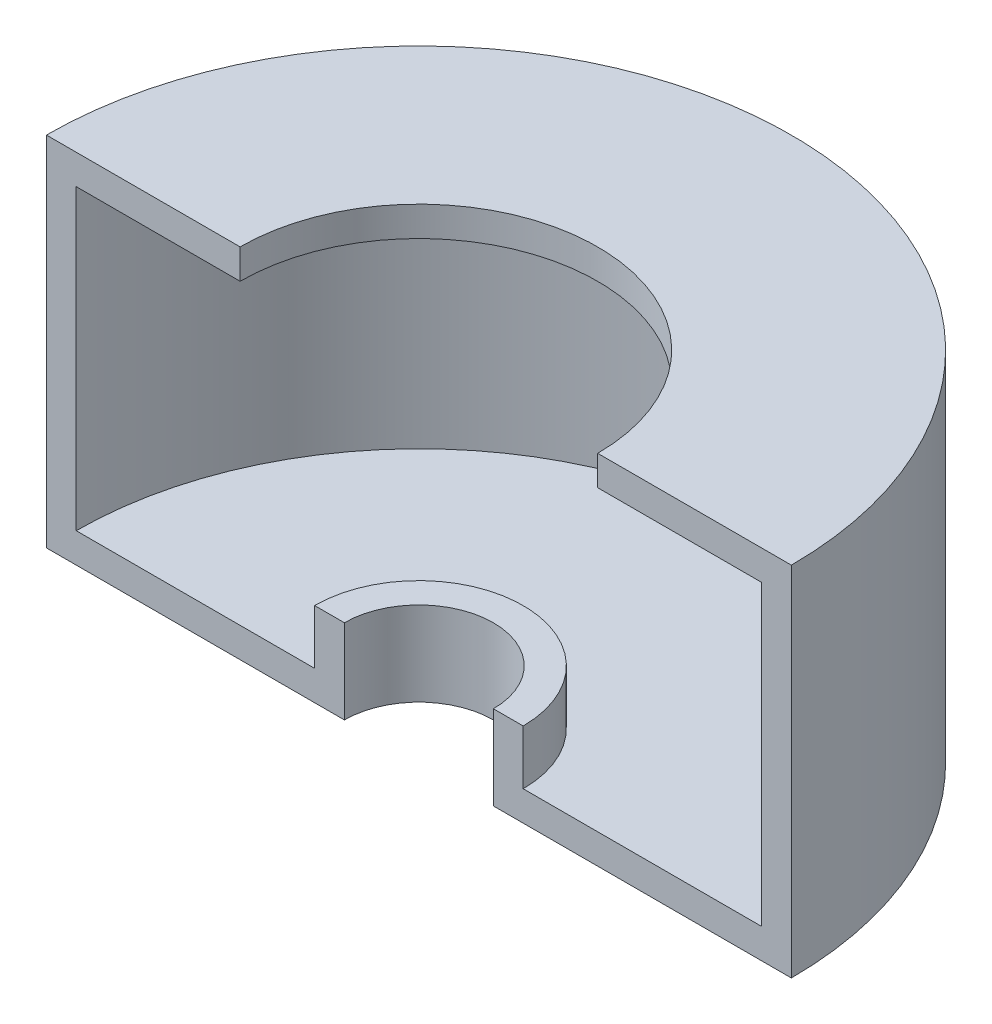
from build123d import *

# Parameters (mm, degrees)
BASE_REVOLVE_THIN_ANGLE = 180


with BuildPart() as part:
    # Sketch1 → Base-Revolve-Thin (revolve)
    with BuildSketch(Plane.XY):
        Polygon((30, 80.872482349), (57.5, 80.872482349), (57.5, 30.872482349), (17.5, 30.872482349), (17.5, 40), (12.5, 40), (12.5, 25.872482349), (62.5, 25.872482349), (62.5, 85.872482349), (30, 85.872482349), align=None)
    revolve(axis=Axis((0, 100, 0), (0, 1, 0)), revolution_arc=BASE_REVOLVE_THIN_ANGLE)


solid = part.part
